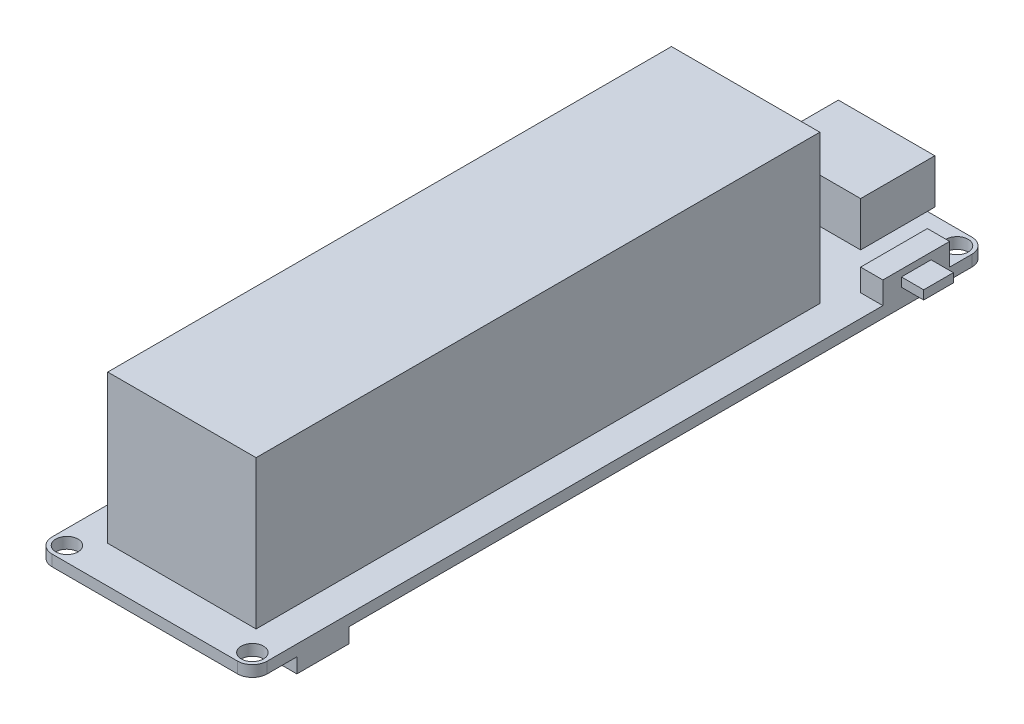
from build123d import *

# Parameters (mm, degrees)
SKETCH1_R            = 1.5
BOSS_EXTRUDE1_DEPTH  = 1.5
SKETCH2_W            = 20
SKETCH2_H            = 76
BOSS_EXTRUDE2_DEPTH  = 20
SKETCH3_W            = 13
SKETCH3_H            = 9
SKETCH3_H_2          = 1
BOSS_EXTRUDE3_DEPTH  = 6
SKETCH3_3_W          = 5
SKETCH3_3_H          = 7
BOSS_EXTRUDE4_DEPTH  = 4
SKETCH3_4_W          = 3
SKETCH3_4_H          = 9
BOSS_EXTRUDE5_DEPTH  = 3
SKETCH4_W            = 3
SKETCH4_H            = 2
BOSS_EXTRUDE6_DEPTH  = 1.2
SKETCH5_W            = 4
SKETCH5_H            = 1.2
BOSS_EXTRUDE7_DEPTH  = 3
SKETCH6_W            = 1.1
SKETCH6_H            = 0.9
BOSS_EXTRUDE8_DEPTH  = 0.2
SKETCH6_3_W          = 6.5
SKETCH6_3_H          = 6.5
BOSS_EXTRUDE9_DEPTH  = 5
SKETCH6_4_W          = 6
SKETCH6_4_H          = 9
BOSS_EXTRUDE10_DEPTH = 3
SKETCH6_5_W          = 5
SKETCH6_5_H          = 7
BOSS_EXTRUDE11_DEPTH = 2


with BuildPart() as part:
    # Sketch1 → Boss-Extrude1 (new body)
    with BuildSketch(Plane(origin=(0, 0, 0), x_dir=(1, 0, 0), z_dir=(0, 1, 0))):
        with BuildLine():
            Line((12.5, -49.5), (-12.5, -49.5))
            ThreePointArc((-12.5, -49.5), (-13.914213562, -48.914213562), (-14.5, -47.5))
            Line((-14.5, -47.5), (-14.5, 47.5))
            ThreePointArc((-14.5, 47.5), (-13.914213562, 48.914213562), (-12.5, 49.5))
            Line((-12.5, 49.5), (12.5, 49.5))
            ThreePointArc((12.5, 49.5), (13.914213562, 48.914213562), (14.5, 47.5))
            Line((14.5, 47.5), (14.5, -47.5))
            ThreePointArc((14.5, -47.5), (13.914213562, -48.914213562), (12.5, -49.5))
        make_face()
        with Locations(Location((-12.5, 47.5, 0), (0, 0, 270))):
            Circle(SKETCH1_R, mode=Mode.SUBTRACT)
        with Locations(Location((12.5, 47.5, 0), (0, 0, 270))):
            Circle(SKETCH1_R, mode=Mode.SUBTRACT)
        with Locations(Location((-12.5, -47.5, 0), (0, 0, 270))):
            Circle(SKETCH1_R, mode=Mode.SUBTRACT)
        with Locations(Location((12.5, -47.5, 0), (0, 0, 270))):
            Circle(SKETCH1_R, mode=Mode.SUBTRACT)
    extrude(amount=BOSS_EXTRUDE1_DEPTH)

    # Sketch2 → Boss-Extrude2 (add)
    with BuildSketch(Plane(origin=(0, 1.5, 0), x_dir=(1, 0, 0), z_dir=(0, 1, 0))):
        with Locations((0, -6.5)):
            Rectangle(SKETCH2_W, SKETCH2_H)
    extrude(amount=BOSS_EXTRUDE2_DEPTH)

    # Sketch3 → Boss-Extrude3 (add)
    with BuildSketch(Plane(origin=(0, 1.5, 0), x_dir=(1, 0, 0), z_dir=(0, 1, 0))):
        with Locations((0, 45)):
            Rectangle(SKETCH3_W, SKETCH3_H)
        with Locations((0, 50)):
            Rectangle(SKETCH3_W, SKETCH3_H_2)
    extrude(amount=BOSS_EXTRUDE3_DEPTH)

    # Sketch3_3 → Boss-Extrude4 (add)
    with BuildSketch(Plane(origin=(0, 1.5, 0), x_dir=(1, 0, 0), z_dir=(0, 1, 0))):
        with Locations((-12, 37)):
            Rectangle(SKETCH3_3_W, SKETCH3_3_H)
    extrude(amount=BOSS_EXTRUDE4_DEPTH)

    # Sketch3_4 → Boss-Extrude5 (add)
    with BuildSketch(Plane(origin=(0, 1.5, 0), x_dir=(1, 0, 0), z_dir=(0, 1, 0))):
        with Locations((13, 40)):
            Rectangle(SKETCH3_4_W, SKETCH3_4_H)
    extrude(amount=BOSS_EXTRUDE5_DEPTH)

    # Sketch4 → Boss-Extrude6 (add)
    with BuildSketch(Plane.ZY.offset(14.5)):
        with Locations((-37, 3.5)):
            Rectangle(SKETCH4_W, SKETCH4_H)
    extrude(amount=BOSS_EXTRUDE6_DEPTH)

    # Sketch5 → Boss-Extrude7 (add)
    with BuildSketch(Plane(origin=(14.5, 0, 0), x_dir=(0, 0, -1), z_dir=(1, 0, 0))):
        with Locations((40, 3)):
            Rectangle(SKETCH5_W, SKETCH5_H)
    extrude(amount=BOSS_EXTRUDE7_DEPTH)

    # Sketch6 → Boss-Extrude8 (add)
    with BuildSketch(Plane.XZ):
        with Locations((-8.95, -30.05)):
            Rectangle(SKETCH6_W, SKETCH6_H)
        with Locations((-8.95, -26.05)):
            Rectangle(SKETCH6_W, SKETCH6_H)
        with Locations((-8.95, -22.05)):
            Rectangle(SKETCH6_W, SKETCH6_H)
        with Locations((-8.95, -18.05)):
            Rectangle(SKETCH6_W, SKETCH6_H)
        with Locations((-8.95, -14.05)):
            Rectangle(SKETCH6_W, SKETCH6_H)
    extrude(amount=BOSS_EXTRUDE8_DEPTH)

    # Sketch6_3 → Boss-Extrude9 (add)
    with BuildSketch(Plane.XZ):
        with Locations((0.25, -4.75)):
            Rectangle(SKETCH6_3_W, SKETCH6_3_H)
    extrude(amount=BOSS_EXTRUDE9_DEPTH)

    # Sketch6_4 → Boss-Extrude10 (add)
    with BuildSketch(Plane.XZ):
        with Locations((-11.5, 26.5)):
            Rectangle(SKETCH6_4_W, SKETCH6_4_H)
    extrude(amount=BOSS_EXTRUDE10_DEPTH)

    # Sketch6_5 → Boss-Extrude11 (add)
    with BuildSketch(Plane.XZ):
        with Locations((12, 40)):
            Rectangle(SKETCH6_5_W, SKETCH6_5_H)
    extrude(amount=BOSS_EXTRUDE11_DEPTH)


solid = part.part
